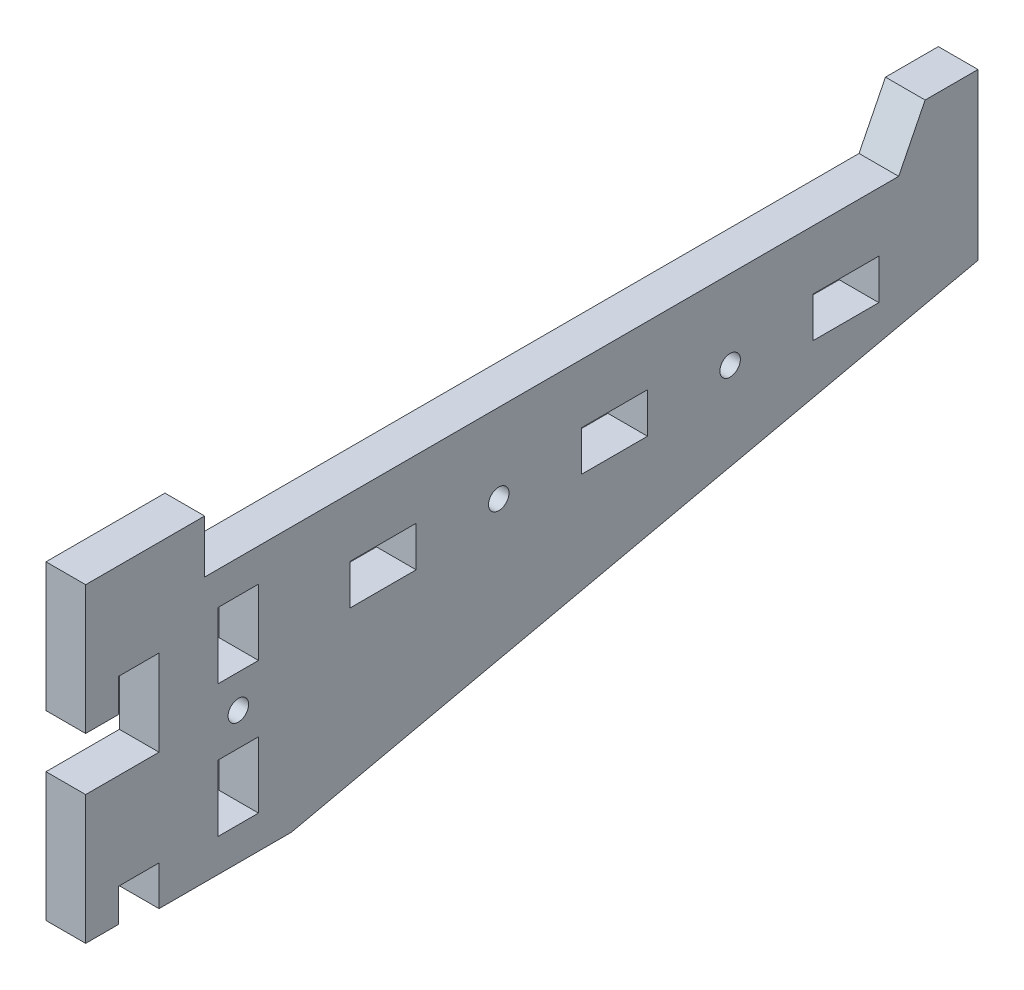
ISO-10303-21;
HEADER;
FILE_DESCRIPTION(('STEP AP214'),'2;1');
FILE_NAME('part.step','',(''),(''),'','','');
FILE_SCHEMA(('AUTOMOTIVE_DESIGN { 1 0 10303 214 1 1 1 1 }'));
ENDSEC;
DATA;
#1=APPLICATION_CONTEXT('core data for automotive mechanical design processes');
#2=APPLICATION_PROTOCOL_DEFINITION('international standard','automotive_design',2000,#1);
#3=PRODUCT_CONTEXT('',#1,'mechanical');
#4=PRODUCT('Part','Part','',(#3));
#5=PRODUCT_RELATED_PRODUCT_CATEGORY('part','',(#4));
#6=PRODUCT_DEFINITION_FORMATION('','',#4);
#7=PRODUCT_DEFINITION_CONTEXT('part definition',#1,'design');
#8=PRODUCT_DEFINITION('design','',#6,#7);
#9=PRODUCT_DEFINITION_SHAPE('','',#8);
#10=(LENGTH_UNIT() NAMED_UNIT(*) SI_UNIT(.MILLI.,.METRE.));
#11=(NAMED_UNIT(*) PLANE_ANGLE_UNIT() SI_UNIT($,.RADIAN.));
#12=(NAMED_UNIT(*) SI_UNIT($,.STERADIAN.) SOLID_ANGLE_UNIT());
#13=UNCERTAINTY_MEASURE_WITH_UNIT(LENGTH_MEASURE(1.E-05),#10,'distance_accuracy_value','');
#14=(GEOMETRIC_REPRESENTATION_CONTEXT(3) GLOBAL_UNCERTAINTY_ASSIGNED_CONTEXT((#13)) GLOBAL_UNIT_ASSIGNED_CONTEXT((#10,
#11,#12)) REPRESENTATION_CONTEXT('',''));
#15=CARTESIAN_POINT('',(0.,0.,0.));
#16=DIRECTION('',(0.,0.,1.));
#17=DIRECTION('',(1.,0.,0.));
#18=AXIS2_PLACEMENT_3D('',#15,#16,#17);
#19=CARTESIAN_POINT('',(6.,0.,-6.90000000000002));
#20=DIRECTION('',(0.,-1.,0.));
#21=DIRECTION('',(0.,0.,-1.));
#22=AXIS2_PLACEMENT_3D('',#19,#20,#21);
#23=PLANE('',#22);
#24=DIRECTION('',(0.,0.,1.));
#25=VECTOR('',#24,1.);
#26=CARTESIAN_POINT('',(0.,0.,-6.90000000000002));
#27=LINE('',#26,#25);
#28=CARTESIAN_POINT('',(0.,0.,-111.9));
#29=VERTEX_POINT('',#28);
#30=CARTESIAN_POINT('',(0.,0.,-6.90000000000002));
#31=VERTEX_POINT('',#30);
#32=EDGE_CURVE('E452',#29,#31,#27,.T.);
#33=ORIENTED_EDGE('',*,*,#32,.T.);
#34=DIRECTION('',(-1.,0.,0.));
#35=VECTOR('',#34,1.);
#36=CARTESIAN_POINT('',(6.,0.,-6.90000000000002));
#37=LINE('',#36,#35);
#38=CARTESIAN_POINT('',(6.,0.,-6.90000000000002));
#39=VERTEX_POINT('',#38);
#40=EDGE_CURVE('E11',#39,#31,#37,.T.);
#41=ORIENTED_EDGE('',*,*,#40,.F.);
#42=DIRECTION('',(0.,0.,1.));
#43=VECTOR('',#42,1.);
#44=CARTESIAN_POINT('',(6.,0.,-6.90000000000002));
#45=LINE('',#44,#43);
#46=CARTESIAN_POINT('',(6.,0.,-111.9));
#47=VERTEX_POINT('',#46);
#48=EDGE_CURVE('E459',#47,#39,#45,.T.);
#49=ORIENTED_EDGE('',*,*,#48,.F.);
#50=DIRECTION('',(-1.,0.,0.));
#51=VECTOR('',#50,1.);
#52=CARTESIAN_POINT('',(6.,0.,-111.9));
#53=LINE('',#52,#51);
#54=EDGE_CURVE('E499',#47,#29,#53,.T.);
#55=ORIENTED_EDGE('',*,*,#54,.T.);
#56=EDGE_LOOP('',(#33,#41,#49,#55));
#57=FACE_BOUND('',#56,.T.);
#58=ADVANCED_FACE('F34',(#57),#23,.F.);
#59=CARTESIAN_POINT('',(6.,8.,-6.90000000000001));
#60=DIRECTION('',(0.,0.,1.));
#61=DIRECTION('',(0.,-1.,0.));
#62=AXIS2_PLACEMENT_3D('',#59,#60,#61);
#63=PLANE('',#62);
#64=DIRECTION('',(0.,1.,0.));
#65=VECTOR('',#64,1.);
#66=CARTESIAN_POINT('',(0.,8.,-6.90000000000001));
#67=LINE('',#66,#65);
#68=CARTESIAN_POINT('',(0.,8.,-6.90000000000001));
#69=VERTEX_POINT('',#68);
#70=EDGE_CURVE('E502',#31,#69,#67,.T.);
#71=ORIENTED_EDGE('',*,*,#70,.T.);
#72=DIRECTION('',(-1.,0.,0.));
#73=VECTOR('',#72,1.);
#74=CARTESIAN_POINT('',(6.,8.,-6.90000000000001));
#75=LINE('',#74,#73);
#76=CARTESIAN_POINT('',(6.,8.,-6.90000000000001));
#77=VERTEX_POINT('',#76);
#78=EDGE_CURVE('E41',#77,#69,#75,.T.);
#79=ORIENTED_EDGE('',*,*,#78,.F.);
#80=DIRECTION('',(0.,1.,0.));
#81=VECTOR('',#80,1.);
#82=CARTESIAN_POINT('',(6.,8.,-6.90000000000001));
#83=LINE('',#82,#81);
#84=EDGE_CURVE('E462',#39,#77,#83,.T.);
#85=ORIENTED_EDGE('',*,*,#84,.F.);
#86=ORIENTED_EDGE('',*,*,#40,.T.);
#87=EDGE_LOOP('',(#71,#79,#85,#86));
#88=FACE_BOUND('',#87,.T.);
#89=ADVANCED_FACE('F613',(#88),#63,.F.);
#90=CARTESIAN_POINT('',(6.,8.,11.1));
#91=DIRECTION('',(0.,-1.,0.));
#92=DIRECTION('',(0.,0.,-1.));
#93=AXIS2_PLACEMENT_3D('',#90,#91,#92);
#94=PLANE('',#93);
#95=DIRECTION('',(0.,0.,1.));
#96=VECTOR('',#95,1.);
#97=CARTESIAN_POINT('',(0.,8.,11.1));
#98=LINE('',#97,#96);
#99=CARTESIAN_POINT('',(0.,8.,11.1));
#100=VERTEX_POINT('',#99);
#101=EDGE_CURVE('E504',#69,#100,#98,.T.);
#102=ORIENTED_EDGE('',*,*,#101,.T.);
#103=DIRECTION('',(-1.,0.,0.));
#104=VECTOR('',#103,1.);
#105=CARTESIAN_POINT('',(6.,8.,11.1));
#106=LINE('',#105,#104);
#107=CARTESIAN_POINT('',(6.,8.,11.1));
#108=VERTEX_POINT('',#107);
#109=EDGE_CURVE('E584',#108,#100,#106,.T.);
#110=ORIENTED_EDGE('',*,*,#109,.F.);
#111=DIRECTION('',(0.,0.,1.));
#112=VECTOR('',#111,1.);
#113=CARTESIAN_POINT('',(6.,8.,11.1));
#114=LINE('',#113,#112);
#115=EDGE_CURVE('E465',#77,#108,#114,.T.);
#116=ORIENTED_EDGE('',*,*,#115,.F.);
#117=ORIENTED_EDGE('',*,*,#78,.T.);
#118=EDGE_LOOP('',(#102,#110,#116,#117));
#119=FACE_BOUND('',#118,.T.);
#120=ADVANCED_FACE('F591',(#119),#94,.F.);
#121=CARTESIAN_POINT('',(6.,-11.5,11.1));
#122=DIRECTION('',(0.,0.,-1.));
#123=DIRECTION('',(-1.,0.,0.));
#124=AXIS2_PLACEMENT_3D('',#121,#122,#123);
#125=PLANE('',#124);
#126=DIRECTION('',(0.,-1.,0.));
#127=VECTOR('',#126,1.);
#128=CARTESIAN_POINT('',(0.,-11.5,11.1));
#129=LINE('',#128,#127);
#130=CARTESIAN_POINT('',(0.,-11.5,11.1));
#131=VERTEX_POINT('',#130);
#132=EDGE_CURVE('E506',#100,#131,#129,.T.);
#133=ORIENTED_EDGE('',*,*,#132,.T.);
#134=DIRECTION('',(-1.,0.,0.));
#135=VECTOR('',#134,1.);
#136=CARTESIAN_POINT('',(6.,-11.5,11.1));
#137=LINE('',#136,#135);
#138=CARTESIAN_POINT('',(6.,-11.5,11.1));
#139=VERTEX_POINT('',#138);
#140=EDGE_CURVE('E581',#139,#131,#137,.T.);
#141=ORIENTED_EDGE('',*,*,#140,.F.);
#142=DIRECTION('',(0.,-1.,0.));
#143=VECTOR('',#142,1.);
#144=CARTESIAN_POINT('',(6.,-11.5,11.1));
#145=LINE('',#144,#143);
#146=EDGE_CURVE('E467',#108,#139,#145,.T.);
#147=ORIENTED_EDGE('',*,*,#146,.F.);
#148=ORIENTED_EDGE('',*,*,#109,.T.);
#149=EDGE_LOOP('',(#133,#141,#147,#148));
#150=FACE_BOUND('',#149,.T.);
#151=ADVANCED_FACE('F601',(#150),#125,.F.);
#152=CARTESIAN_POINT('',(6.,-11.5,6.09999999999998));
#153=DIRECTION('',(0.,1.,0.));
#154=DIRECTION('',(0.,0.,1.));
#155=AXIS2_PLACEMENT_3D('',#152,#153,#154);
#156=PLANE('',#155);
#157=DIRECTION('',(0.,0.,-1.));
#158=VECTOR('',#157,1.);
#159=CARTESIAN_POINT('',(0.,-11.5,6.09999999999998));
#160=LINE('',#159,#158);
#161=CARTESIAN_POINT('',(0.,-11.5,6.09999999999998));
#162=VERTEX_POINT('',#161);
#163=EDGE_CURVE('E508',#131,#162,#160,.T.);
#164=ORIENTED_EDGE('',*,*,#163,.T.);
#165=DIRECTION('',(-1.,0.,0.));
#166=VECTOR('',#165,1.);
#167=CARTESIAN_POINT('',(6.,-11.5,6.09999999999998));
#168=LINE('',#167,#166);
#169=CARTESIAN_POINT('',(6.,-11.5,6.09999999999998));
#170=VERTEX_POINT('',#169);
#171=EDGE_CURVE('E578',#170,#162,#168,.T.);
#172=ORIENTED_EDGE('',*,*,#171,.F.);
#173=DIRECTION('',(0.,0.,-1.));
#174=VECTOR('',#173,1.);
#175=CARTESIAN_POINT('',(6.,-11.5,6.09999999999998));
#176=LINE('',#175,#174);
#177=EDGE_CURVE('E469',#139,#170,#176,.T.);
#178=ORIENTED_EDGE('',*,*,#177,.F.);
#179=ORIENTED_EDGE('',*,*,#140,.T.);
#180=EDGE_LOOP('',(#164,#172,#178,#179));
#181=FACE_BOUND('',#180,.T.);
#182=ADVANCED_FACE('F605',(#181),#156,.F.);
#183=CARTESIAN_POINT('',(6.,-6.5,6.09999999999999));
#184=DIRECTION('',(0.,0.,1.));
#185=DIRECTION('',(0.,-1.,0.));
#186=AXIS2_PLACEMENT_3D('',#183,#184,#185);
#187=PLANE('',#186);
#188=DIRECTION('',(0.,1.,0.));
#189=VECTOR('',#188,1.);
#190=CARTESIAN_POINT('',(0.,-6.5,6.09999999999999));
#191=LINE('',#190,#189);
#192=CARTESIAN_POINT('',(0.,-6.5,6.09999999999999));
#193=VERTEX_POINT('',#192);
#194=EDGE_CURVE('E510',#162,#193,#191,.T.);
#195=ORIENTED_EDGE('',*,*,#194,.T.);
#196=DIRECTION('',(-1.,0.,0.));
#197=VECTOR('',#196,1.);
#198=CARTESIAN_POINT('',(6.,-6.5,6.09999999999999));
#199=LINE('',#198,#197);
#200=CARTESIAN_POINT('',(6.,-6.5,6.09999999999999));
#201=VERTEX_POINT('',#200);
#202=EDGE_CURVE('E575',#201,#193,#199,.T.);
#203=ORIENTED_EDGE('',*,*,#202,.F.);
#204=DIRECTION('',(0.,1.,0.));
#205=VECTOR('',#204,1.);
#206=CARTESIAN_POINT('',(6.,-6.5,6.09999999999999));
#207=LINE('',#206,#205);
#208=EDGE_CURVE('E471',#170,#201,#207,.T.);
#209=ORIENTED_EDGE('',*,*,#208,.F.);
#210=ORIENTED_EDGE('',*,*,#171,.T.);
#211=EDGE_LOOP('',(#195,#203,#209,#210));
#212=FACE_BOUND('',#211,.T.);
#213=ADVANCED_FACE('F681',(#212),#187,.F.);
#214=CARTESIAN_POINT('',(6.,-6.5,0.));
#215=DIRECTION('',(0.,1.,0.));
#216=DIRECTION('',(0.,0.,1.));
#217=AXIS2_PLACEMENT_3D('',#214,#215,#216);
#218=PLANE('',#217);
#219=DIRECTION('',(0.,0.,-1.));
#220=VECTOR('',#219,1.);
#221=CARTESIAN_POINT('',(0.,-6.5,0.));
#222=LINE('',#221,#220);
#223=CARTESIAN_POINT('',(0.,-6.5,0.));
#224=VERTEX_POINT('',#223);
#225=EDGE_CURVE('E512',#193,#224,#222,.T.);
#226=ORIENTED_EDGE('',*,*,#225,.T.);
#227=DIRECTION('',(-1.,0.,0.));
#228=VECTOR('',#227,1.);
#229=CARTESIAN_POINT('',(6.,-6.5,0.));
#230=LINE('',#229,#228);
#231=CARTESIAN_POINT('',(6.,-6.5,0.));
#232=VERTEX_POINT('',#231);
#233=EDGE_CURVE('E572',#232,#224,#230,.T.);
#234=ORIENTED_EDGE('',*,*,#233,.F.);
#235=DIRECTION('',(0.,0.,-1.));
#236=VECTOR('',#235,1.);
#237=CARTESIAN_POINT('',(6.,-6.5,0.));
#238=LINE('',#237,#236);
#239=EDGE_CURVE('E473',#201,#232,#238,.T.);
#240=ORIENTED_EDGE('',*,*,#239,.F.);
#241=ORIENTED_EDGE('',*,*,#202,.T.);
#242=EDGE_LOOP('',(#226,#234,#240,#241));
#243=FACE_BOUND('',#242,.T.);
#244=ADVANCED_FACE('F678',(#243),#218,.F.);
#245=CARTESIAN_POINT('',(6.,-19.5,0.));
#246=DIRECTION('',(0.,0.,-1.));
#247=DIRECTION('',(0.,1.,0.));
#248=AXIS2_PLACEMENT_3D('',#245,#246,#247);
#249=PLANE('',#248);
#250=DIRECTION('',(0.,-1.,0.));
#251=VECTOR('',#250,1.);
#252=CARTESIAN_POINT('',(0.,-19.5,0.));
#253=LINE('',#252,#251);
#254=CARTESIAN_POINT('',(0.,-19.5,0.));
#255=VERTEX_POINT('',#254);
#256=EDGE_CURVE('E514',#224,#255,#253,.T.);
#257=ORIENTED_EDGE('',*,*,#256,.T.);
#258=DIRECTION('',(-1.,0.,0.));
#259=VECTOR('',#258,1.);
#260=CARTESIAN_POINT('',(6.,-19.5,0.));
#261=LINE('',#260,#259);
#262=CARTESIAN_POINT('',(6.,-19.5,0.));
#263=VERTEX_POINT('',#262);
#264=EDGE_CURVE('E569',#263,#255,#261,.T.);
#265=ORIENTED_EDGE('',*,*,#264,.F.);
#266=DIRECTION('',(0.,-1.,0.));
#267=VECTOR('',#266,1.);
#268=CARTESIAN_POINT('',(6.,-19.5,0.));
#269=LINE('',#268,#267);
#270=EDGE_CURVE('E475',#232,#263,#269,.T.);
#271=ORIENTED_EDGE('',*,*,#270,.F.);
#272=ORIENTED_EDGE('',*,*,#233,.T.);
#273=EDGE_LOOP('',(#257,#265,#271,#272));
#274=FACE_BOUND('',#273,.T.);
#275=ADVANCED_FACE('F674',(#274),#249,.F.);
#276=CARTESIAN_POINT('',(6.,-19.5,11.1));
#277=DIRECTION('',(0.,-1.,0.));
#278=DIRECTION('',(0.,0.,-1.));
#279=AXIS2_PLACEMENT_3D('',#276,#277,#278);
#280=PLANE('',#279);
#281=DIRECTION('',(0.,0.,1.));
#282=VECTOR('',#281,1.);
#283=CARTESIAN_POINT('',(0.,-19.5,11.1));
#284=LINE('',#283,#282);
#285=CARTESIAN_POINT('',(0.,-19.5,11.1));
#286=VERTEX_POINT('',#285);
#287=EDGE_CURVE('E516',#255,#286,#284,.T.);
#288=ORIENTED_EDGE('',*,*,#287,.T.);
#289=DIRECTION('',(-1.,0.,0.));
#290=VECTOR('',#289,1.);
#291=CARTESIAN_POINT('',(6.,-19.5,11.1));
#292=LINE('',#291,#290);
#293=CARTESIAN_POINT('',(6.,-19.5,11.1));
#294=VERTEX_POINT('',#293);
#295=EDGE_CURVE('E566',#294,#286,#292,.T.);
#296=ORIENTED_EDGE('',*,*,#295,.F.);
#297=DIRECTION('',(0.,0.,1.));
#298=VECTOR('',#297,1.);
#299=CARTESIAN_POINT('',(6.,-19.5,11.1));
#300=LINE('',#299,#298);
#301=EDGE_CURVE('E477',#263,#294,#300,.T.);
#302=ORIENTED_EDGE('',*,*,#301,.F.);
#303=ORIENTED_EDGE('',*,*,#264,.T.);
#304=EDGE_LOOP('',(#288,#296,#302,#303));
#305=FACE_BOUND('',#304,.T.);
#306=ADVANCED_FACE('F670',(#305),#280,.F.);
#307=CARTESIAN_POINT('',(6.,-39.,11.1));
#308=DIRECTION('',(0.,0.,-1.));
#309=DIRECTION('',(-1.,0.,0.));
#310=AXIS2_PLACEMENT_3D('',#307,#308,#309);
#311=PLANE('',#310);
#312=DIRECTION('',(0.,-1.,0.));
#313=VECTOR('',#312,1.);
#314=CARTESIAN_POINT('',(0.,-39.,11.1));
#315=LINE('',#314,#313);
#316=CARTESIAN_POINT('',(0.,-39.,11.1));
#317=VERTEX_POINT('',#316);
#318=EDGE_CURVE('E518',#286,#317,#315,.T.);
#319=ORIENTED_EDGE('',*,*,#318,.T.);
#320=DIRECTION('',(-1.,0.,0.));
#321=VECTOR('',#320,1.);
#322=CARTESIAN_POINT('',(6.,-39.,11.1));
#323=LINE('',#322,#321);
#324=CARTESIAN_POINT('',(6.,-39.,11.1));
#325=VERTEX_POINT('',#324);
#326=EDGE_CURVE('E563',#325,#317,#323,.T.);
#327=ORIENTED_EDGE('',*,*,#326,.F.);
#328=DIRECTION('',(0.,-1.,0.));
#329=VECTOR('',#328,1.);
#330=CARTESIAN_POINT('',(6.,-39.,11.1));
#331=LINE('',#330,#329);
#332=EDGE_CURVE('E479',#294,#325,#331,.T.);
#333=ORIENTED_EDGE('',*,*,#332,.F.);
#334=ORIENTED_EDGE('',*,*,#295,.T.);
#335=EDGE_LOOP('',(#319,#327,#333,#334));
#336=FACE_BOUND('',#335,.T.);
#337=ADVANCED_FACE('F665',(#336),#311,.F.);
#338=CARTESIAN_POINT('',(6.,-39.,6.09999999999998));
#339=DIRECTION('',(0.,1.,0.));
#340=DIRECTION('',(0.,0.,1.));
#341=AXIS2_PLACEMENT_3D('',#338,#339,#340);
#342=PLANE('',#341);
#343=DIRECTION('',(0.,0.,-1.));
#344=VECTOR('',#343,1.);
#345=CARTESIAN_POINT('',(0.,-39.,6.09999999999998));
#346=LINE('',#345,#344);
#347=CARTESIAN_POINT('',(0.,-39.,6.09999999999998));
#348=VERTEX_POINT('',#347);
#349=EDGE_CURVE('E520',#317,#348,#346,.T.);
#350=ORIENTED_EDGE('',*,*,#349,.T.);
#351=DIRECTION('',(-1.,0.,0.));
#352=VECTOR('',#351,1.);
#353=CARTESIAN_POINT('',(6.,-39.,6.09999999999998));
#354=LINE('',#353,#352);
#355=CARTESIAN_POINT('',(6.,-39.,6.09999999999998));
#356=VERTEX_POINT('',#355);
#357=EDGE_CURVE('E560',#356,#348,#354,.T.);
#358=ORIENTED_EDGE('',*,*,#357,.F.);
#359=DIRECTION('',(0.,0.,-1.));
#360=VECTOR('',#359,1.);
#361=CARTESIAN_POINT('',(6.,-39.,6.09999999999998));
#362=LINE('',#361,#360);
#363=EDGE_CURVE('E481',#325,#356,#362,.T.);
#364=ORIENTED_EDGE('',*,*,#363,.F.);
#365=ORIENTED_EDGE('',*,*,#326,.T.);
#366=EDGE_LOOP('',(#350,#358,#364,#365));
#367=FACE_BOUND('',#366,.T.);
#368=ADVANCED_FACE('F659',(#367),#342,.F.);
#369=CARTESIAN_POINT('',(6.,-34.,6.09999999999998));
#370=DIRECTION('',(0.,0.,1.));
#371=DIRECTION('',(0.,-1.,0.));
#372=AXIS2_PLACEMENT_3D('',#369,#370,#371);
#373=PLANE('',#372);
#374=DIRECTION('',(0.,1.,0.));
#375=VECTOR('',#374,1.);
#376=CARTESIAN_POINT('',(0.,-34.,6.09999999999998));
#377=LINE('',#376,#375);
#378=CARTESIAN_POINT('',(0.,-34.,6.09999999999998));
#379=VERTEX_POINT('',#378);
#380=EDGE_CURVE('E522',#348,#379,#377,.T.);
#381=ORIENTED_EDGE('',*,*,#380,.T.);
#382=DIRECTION('',(-1.,0.,0.));
#383=VECTOR('',#382,1.);
#384=CARTESIAN_POINT('',(6.,-34.,6.09999999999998));
#385=LINE('',#384,#383);
#386=CARTESIAN_POINT('',(6.,-34.,6.09999999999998));
#387=VERTEX_POINT('',#386);
#388=EDGE_CURVE('E557',#387,#379,#385,.T.);
#389=ORIENTED_EDGE('',*,*,#388,.F.);
#390=DIRECTION('',(0.,1.,0.));
#391=VECTOR('',#390,1.);
#392=CARTESIAN_POINT('',(6.,-34.,6.09999999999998));
#393=LINE('',#392,#391);
#394=EDGE_CURVE('E483',#356,#387,#393,.T.);
#395=ORIENTED_EDGE('',*,*,#394,.F.);
#396=ORIENTED_EDGE('',*,*,#357,.T.);
#397=EDGE_LOOP('',(#381,#389,#395,#396));
#398=FACE_BOUND('',#397,.T.);
#399=ADVANCED_FACE('F655',(#398),#373,.F.);
#400=CARTESIAN_POINT('',(6.,-34.,0.));
#401=DIRECTION('',(0.,1.,0.));
#402=DIRECTION('',(0.,0.,1.));
#403=AXIS2_PLACEMENT_3D('',#400,#401,#402);
#404=PLANE('',#403);
#405=DIRECTION('',(0.,0.,-1.));
#406=VECTOR('',#405,1.);
#407=CARTESIAN_POINT('',(0.,-34.,0.));
#408=LINE('',#407,#406);
#409=CARTESIAN_POINT('',(0.,-34.,0.));
#410=VERTEX_POINT('',#409);
#411=EDGE_CURVE('E524',#379,#410,#408,.T.);
#412=ORIENTED_EDGE('',*,*,#411,.T.);
#413=DIRECTION('',(-1.,0.,0.));
#414=VECTOR('',#413,1.);
#415=CARTESIAN_POINT('',(6.,-34.,0.));
#416=LINE('',#415,#414);
#417=CARTESIAN_POINT('',(6.,-34.,0.));
#418=VERTEX_POINT('',#417);
#419=EDGE_CURVE('E554',#418,#410,#416,.T.);
#420=ORIENTED_EDGE('',*,*,#419,.F.);
#421=DIRECTION('',(0.,0.,-1.));
#422=VECTOR('',#421,1.);
#423=CARTESIAN_POINT('',(6.,-34.,0.));
#424=LINE('',#423,#422);
#425=EDGE_CURVE('E485',#387,#418,#424,.T.);
#426=ORIENTED_EDGE('',*,*,#425,.F.);
#427=ORIENTED_EDGE('',*,*,#388,.T.);
#428=EDGE_LOOP('',(#412,#420,#426,#427));
#429=FACE_BOUND('',#428,.T.);
#430=ADVANCED_FACE('F650',(#429),#404,.F.);
#431=CARTESIAN_POINT('',(6.,-40.,0.));
#432=DIRECTION('',(0.,0.,-1.));
#433=DIRECTION('',(-1.,0.,0.));
#434=AXIS2_PLACEMENT_3D('',#431,#432,#433);
#435=PLANE('',#434);
#436=DIRECTION('',(0.,-1.,0.));
#437=VECTOR('',#436,1.);
#438=CARTESIAN_POINT('',(0.,-40.,0.));
#439=LINE('',#438,#437);
#440=CARTESIAN_POINT('',(0.,-40.,0.));
#441=VERTEX_POINT('',#440);
#442=EDGE_CURVE('E526',#410,#441,#439,.T.);
#443=ORIENTED_EDGE('',*,*,#442,.T.);
#444=DIRECTION('',(-1.,0.,0.));
#445=VECTOR('',#444,1.);
#446=CARTESIAN_POINT('',(6.,-40.,0.));
#447=LINE('',#446,#445);
#448=CARTESIAN_POINT('',(6.,-40.,0.));
#449=VERTEX_POINT('',#448);
#450=EDGE_CURVE('E551',#449,#441,#447,.T.);
#451=ORIENTED_EDGE('',*,*,#450,.F.);
#452=DIRECTION('',(0.,-1.,0.));
#453=VECTOR('',#452,1.);
#454=CARTESIAN_POINT('',(6.,-40.,0.));
#455=LINE('',#454,#453);
#456=EDGE_CURVE('E487',#418,#449,#455,.T.);
#457=ORIENTED_EDGE('',*,*,#456,.F.);
#458=ORIENTED_EDGE('',*,*,#419,.T.);
#459=EDGE_LOOP('',(#443,#451,#457,#458));
#460=FACE_BOUND('',#459,.T.);
#461=ADVANCED_FACE('F644',(#460),#435,.F.);
#462=CARTESIAN_POINT('',(6.,-40.,0.));
#463=DIRECTION('',(0.,1.,0.));
#464=DIRECTION('',(0.,0.,1.));
#465=AXIS2_PLACEMENT_3D('',#462,#463,#464);
#466=PLANE('',#465);
#467=DIRECTION('',(0.,0.,-1.));
#468=VECTOR('',#467,1.);
#469=CARTESIAN_POINT('',(0.,-40.,0.));
#470=LINE('',#469,#468);
#471=CARTESIAN_POINT('',(0.,-40.,-20.));
#472=VERTEX_POINT('',#471);
#473=EDGE_CURVE('E528',#441,#472,#470,.T.);
#474=ORIENTED_EDGE('',*,*,#473,.T.);
#475=DIRECTION('',(-1.,0.,0.));
#476=VECTOR('',#475,1.);
#477=CARTESIAN_POINT('',(6.,-40.,-20.));
#478=LINE('',#477,#476);
#479=CARTESIAN_POINT('',(6.,-40.,-20.));
#480=VERTEX_POINT('',#479);
#481=EDGE_CURVE('E548',#480,#472,#478,.T.);
#482=ORIENTED_EDGE('',*,*,#481,.F.);
#483=DIRECTION('',(0.,0.,-1.));
#484=VECTOR('',#483,1.);
#485=CARTESIAN_POINT('',(6.,-40.,0.));
#486=LINE('',#485,#484);
#487=EDGE_CURVE('E489',#449,#480,#486,.T.);
#488=ORIENTED_EDGE('',*,*,#487,.F.);
#489=ORIENTED_EDGE('',*,*,#450,.T.);
#490=EDGE_LOOP('',(#474,#482,#488,#489));
#491=FACE_BOUND('',#490,.T.);
#492=ADVANCED_FACE('F640',(#491),#466,.F.);
#493=CARTESIAN_POINT('',(6.,-40.,-20.));
#494=DIRECTION('',(0.,0.976363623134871,0.216134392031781));
#495=DIRECTION('',(0.,-0.216134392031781,0.976363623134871));
#496=AXIS2_PLACEMENT_3D('',#493,#494,#495);
#497=PLANE('',#496);
#498=DIRECTION('',(0.,0.216134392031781,-0.976363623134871));
#499=VECTOR('',#498,1.);
#500=CARTESIAN_POINT('',(0.,-40.,-20.));
#501=LINE('',#500,#499);
#502=CARTESIAN_POINT('',(0.,-17.,-123.9));
#503=VERTEX_POINT('',#502);
#504=EDGE_CURVE('E530',#472,#503,#501,.T.);
#505=ORIENTED_EDGE('',*,*,#504,.T.);
#506=DIRECTION('',(-1.,0.,0.));
#507=VECTOR('',#506,1.);
#508=CARTESIAN_POINT('',(6.,-17.,-123.9));
#509=LINE('',#508,#507);
#510=CARTESIAN_POINT('',(6.,-17.,-123.9));
#511=VERTEX_POINT('',#510);
#512=EDGE_CURVE('E545',#511,#503,#509,.T.);
#513=ORIENTED_EDGE('',*,*,#512,.F.);
#514=DIRECTION('',(0.,0.216134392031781,-0.976363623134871));
#515=VECTOR('',#514,1.);
#516=CARTESIAN_POINT('',(6.,-40.,-20.));
#517=LINE('',#516,#515);
#518=EDGE_CURVE('E491',#480,#511,#517,.T.);
#519=ORIENTED_EDGE('',*,*,#518,.F.);
#520=ORIENTED_EDGE('',*,*,#481,.T.);
#521=EDGE_LOOP('',(#505,#513,#519,#520));
#522=FACE_BOUND('',#521,.T.);
#523=ADVANCED_FACE('F635',(#522),#497,.F.);
#524=CARTESIAN_POINT('',(6.,8.,-123.9));
#525=DIRECTION('',(0.,0.,1.));
#526=DIRECTION('',(1.,0.,0.));
#527=AXIS2_PLACEMENT_3D('',#524,#525,#526);
#528=PLANE('',#527);
#529=DIRECTION('',(0.,1.,0.));
#530=VECTOR('',#529,1.);
#531=CARTESIAN_POINT('',(0.,8.,-123.9));
#532=LINE('',#531,#530);
#533=CARTESIAN_POINT('',(0.,8.,-123.9));
#534=VERTEX_POINT('',#533);
#535=EDGE_CURVE('E532',#503,#534,#532,.T.);
#536=ORIENTED_EDGE('',*,*,#535,.T.);
#537=DIRECTION('',(-1.,0.,0.));
#538=VECTOR('',#537,1.);
#539=CARTESIAN_POINT('',(6.,8.,-123.9));
#540=LINE('',#539,#538);
#541=CARTESIAN_POINT('',(6.,8.,-123.9));
#542=VERTEX_POINT('',#541);
#543=EDGE_CURVE('E542',#542,#534,#540,.T.);
#544=ORIENTED_EDGE('',*,*,#543,.F.);
#545=DIRECTION('',(0.,1.,0.));
#546=VECTOR('',#545,1.);
#547=CARTESIAN_POINT('',(6.,8.,-123.9));
#548=LINE('',#547,#546);
#549=EDGE_CURVE('E493',#511,#542,#548,.T.);
#550=ORIENTED_EDGE('',*,*,#549,.F.);
#551=ORIENTED_EDGE('',*,*,#512,.T.);
#552=EDGE_LOOP('',(#536,#544,#550,#551));
#553=FACE_BOUND('',#552,.T.);
#554=ADVANCED_FACE('F629',(#553),#528,.F.);
#555=CARTESIAN_POINT('',(6.,8.,-115.9));
#556=DIRECTION('',(0.,-1.,0.));
#557=DIRECTION('',(0.,0.,-1.));
#558=AXIS2_PLACEMENT_3D('',#555,#556,#557);
#559=PLANE('',#558);
#560=DIRECTION('',(0.,0.,1.));
#561=VECTOR('',#560,1.);
#562=CARTESIAN_POINT('',(0.,8.,-115.9));
#563=LINE('',#562,#561);
#564=CARTESIAN_POINT('',(0.,8.,-115.9));
#565=VERTEX_POINT('',#564);
#566=EDGE_CURVE('E534',#534,#565,#563,.T.);
#567=ORIENTED_EDGE('',*,*,#566,.T.);
#568=DIRECTION('',(-1.,0.,0.));
#569=VECTOR('',#568,1.);
#570=CARTESIAN_POINT('',(6.,8.,-115.9));
#571=LINE('',#570,#569);
#572=CARTESIAN_POINT('',(6.,8.,-115.9));
#573=VERTEX_POINT('',#572);
#574=EDGE_CURVE('E539',#573,#565,#571,.T.);
#575=ORIENTED_EDGE('',*,*,#574,.F.);
#576=DIRECTION('',(0.,0.,1.));
#577=VECTOR('',#576,1.);
#578=CARTESIAN_POINT('',(6.,8.,-115.9));
#579=LINE('',#578,#577);
#580=EDGE_CURVE('E495',#542,#573,#579,.T.);
#581=ORIENTED_EDGE('',*,*,#580,.F.);
#582=ORIENTED_EDGE('',*,*,#543,.T.);
#583=EDGE_LOOP('',(#567,#575,#581,#582));
#584=FACE_BOUND('',#583,.T.);
#585=ADVANCED_FACE('F625',(#584),#559,.F.);
#586=CARTESIAN_POINT('',(6.,0.,-111.9));
#587=DIRECTION('',(0.,-0.447213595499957,-0.894427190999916));
#588=DIRECTION('',(0.,0.894427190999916,-0.447213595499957));
#589=AXIS2_PLACEMENT_3D('',#586,#587,#588);
#590=PLANE('',#589);
#591=DIRECTION('',(0.,-0.894427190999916,0.447213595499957));
#592=VECTOR('',#591,1.);
#593=CARTESIAN_POINT('',(0.,0.,-111.9));
#594=LINE('',#593,#592);
#595=EDGE_CURVE('E463',#565,#29,#594,.T.);
#596=ORIENTED_EDGE('',*,*,#595,.T.);
#597=ORIENTED_EDGE('',*,*,#54,.F.);
#598=DIRECTION('',(0.,-0.894427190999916,0.447213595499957));
#599=VECTOR('',#598,1.);
#600=CARTESIAN_POINT('',(6.,0.,-111.9));
#601=LINE('',#600,#599);
#602=EDGE_CURVE('E497',#573,#47,#601,.T.);
#603=ORIENTED_EDGE('',*,*,#602,.F.);
#604=ORIENTED_EDGE('',*,*,#574,.T.);
#605=EDGE_LOOP('',(#596,#597,#603,#604));
#606=FACE_BOUND('',#605,.T.);
#607=ADVANCED_FACE('F620',(#606),#590,.F.);
#608=CARTESIAN_POINT('',(6.,0.,0.));
#609=DIRECTION('',(-1.,0.,0.));
#610=DIRECTION('',(0.,0.,1.));
#611=AXIS2_PLACEMENT_3D('',#608,#609,#610);
#612=PLANE('',#611);
#613=CARTESIAN_POINT('',(6.,-12.,-86.4));
#614=DIRECTION('',(1.,0.,0.));
#615=DIRECTION('',(0.,0.,-1.));
#616=AXIS2_PLACEMENT_3D('',#613,#614,#615);
#617=CIRCLE('',#616,1.54999999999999);
#618=CARTESIAN_POINT('',(6.,-12.,-87.95));
#619=VERTEX_POINT('',#618);
#620=EDGE_CURVE('E1067',#619,#619,#617,.T.);
#621=ORIENTED_EDGE('',*,*,#620,.F.);
#622=EDGE_LOOP('',(#621));
#623=FACE_BOUND('',#622,.T.);
#624=CARTESIAN_POINT('',(6.,-12.,-51.4));
#625=DIRECTION('',(1.,0.,0.));
#626=DIRECTION('',(0.,0.,-1.));
#627=AXIS2_PLACEMENT_3D('',#624,#625,#626);
#628=CIRCLE('',#627,1.55);
#629=CARTESIAN_POINT('',(6.,-12.,-52.95));
#630=VERTEX_POINT('',#629);
#631=EDGE_CURVE('E308',#630,#630,#628,.T.);
#632=ORIENTED_EDGE('',*,*,#631,.F.);
#633=EDGE_LOOP('',(#632));
#634=FACE_BOUND('',#633,.T.);
#635=DIRECTION('',(0.,0.,-1.));
#636=VECTOR('',#635,1.);
#637=CARTESIAN_POINT('',(6.,-15.05,-98.9));
#638=LINE('',#637,#636);
#639=CARTESIAN_POINT('',(6.,-15.05,-98.9));
#640=VERTEX_POINT('',#639);
#641=CARTESIAN_POINT('',(6.,-15.05,-108.9));
#642=VERTEX_POINT('',#641);
#643=EDGE_CURVE('E314',#640,#642,#638,.T.);
#644=ORIENTED_EDGE('',*,*,#643,.F.);
#645=DIRECTION('',(0.,-1.,0.));
#646=VECTOR('',#645,1.);
#647=CARTESIAN_POINT('',(6.,-8.95000000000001,-98.9));
#648=LINE('',#647,#646);
#649=CARTESIAN_POINT('',(6.,-8.95000000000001,-98.9));
#650=VERTEX_POINT('',#649);
#651=EDGE_CURVE('E48',#650,#640,#648,.T.);
#652=ORIENTED_EDGE('',*,*,#651,.F.);
#653=DIRECTION('',(0.,0.,1.));
#654=VECTOR('',#653,1.);
#655=CARTESIAN_POINT('',(6.,-8.95000000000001,-98.9));
#656=LINE('',#655,#654);
#657=CARTESIAN_POINT('',(6.,-8.95000000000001,-108.9));
#658=VERTEX_POINT('',#657);
#659=EDGE_CURVE('E302',#658,#650,#656,.T.);
#660=ORIENTED_EDGE('',*,*,#659,.F.);
#661=DIRECTION('',(0.,1.,0.));
#662=VECTOR('',#661,1.);
#663=CARTESIAN_POINT('',(6.,-8.95000000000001,-108.9));
#664=LINE('',#663,#662);
#665=EDGE_CURVE('E305',#642,#658,#664,.T.);
#666=ORIENTED_EDGE('',*,*,#665,.F.);
#667=EDGE_LOOP('',(#644,#652,#660,#666));
#668=FACE_BOUND('',#667,.T.);
#669=DIRECTION('',(0.,0.,-1.));
#670=VECTOR('',#669,1.);
#671=CARTESIAN_POINT('',(6.,-15.05,-63.9));
#672=LINE('',#671,#670);
#673=CARTESIAN_POINT('',(6.,-15.05,-63.9));
#674=VERTEX_POINT('',#673);
#675=CARTESIAN_POINT('',(6.,-15.05,-73.9));
#676=VERTEX_POINT('',#675);
#677=EDGE_CURVE('E340',#674,#676,#672,.T.);
#678=ORIENTED_EDGE('',*,*,#677,.F.);
#679=DIRECTION('',(0.,-1.,0.));
#680=VECTOR('',#679,1.);
#681=CARTESIAN_POINT('',(6.,-8.95000000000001,-63.9));
#682=LINE('',#681,#680);
#683=CARTESIAN_POINT('',(6.,-8.95000000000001,-63.9));
#684=VERTEX_POINT('',#683);
#685=EDGE_CURVE('E321',#684,#674,#682,.T.);
#686=ORIENTED_EDGE('',*,*,#685,.F.);
#687=DIRECTION('',(0.,0.,1.));
#688=VECTOR('',#687,1.);
#689=CARTESIAN_POINT('',(6.,-8.95000000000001,-63.9));
#690=LINE('',#689,#688);
#691=CARTESIAN_POINT('',(6.,-8.95000000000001,-73.9));
#692=VERTEX_POINT('',#691);
#693=EDGE_CURVE('E329',#692,#684,#690,.T.);
#694=ORIENTED_EDGE('',*,*,#693,.F.);
#695=DIRECTION('',(0.,1.,0.));
#696=VECTOR('',#695,1.);
#697=CARTESIAN_POINT('',(6.,-8.95000000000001,-73.9));
#698=LINE('',#697,#696);
#699=EDGE_CURVE('E343',#676,#692,#698,.T.);
#700=ORIENTED_EDGE('',*,*,#699,.F.);
#701=EDGE_LOOP('',(#678,#686,#694,#700));
#702=FACE_BOUND('',#701,.T.);
#703=DIRECTION('',(0.,0.,-1.));
#704=VECTOR('',#703,1.);
#705=CARTESIAN_POINT('',(6.,-15.05,-28.9));
#706=LINE('',#705,#704);
#707=CARTESIAN_POINT('',(6.,-15.05,-28.9));
#708=VERTEX_POINT('',#707);
#709=CARTESIAN_POINT('',(6.,-15.05,-38.9));
#710=VERTEX_POINT('',#709);
#711=EDGE_CURVE('E372',#708,#710,#706,.T.);
#712=ORIENTED_EDGE('',*,*,#711,.F.);
#713=DIRECTION('',(0.,-1.,0.));
#714=VECTOR('',#713,1.);
#715=CARTESIAN_POINT('',(6.,-8.95000000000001,-28.9));
#716=LINE('',#715,#714);
#717=CARTESIAN_POINT('',(6.,-8.95000000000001,-28.9));
#718=VERTEX_POINT('',#717);
#719=EDGE_CURVE('E350',#718,#708,#716,.T.);
#720=ORIENTED_EDGE('',*,*,#719,.F.);
#721=DIRECTION('',(0.,0.,1.));
#722=VECTOR('',#721,1.);
#723=CARTESIAN_POINT('',(6.,-8.95000000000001,-28.9));
#724=LINE('',#723,#722);
#725=CARTESIAN_POINT('',(6.,-8.95000000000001,-38.9));
#726=VERTEX_POINT('',#725);
#727=EDGE_CURVE('E361',#726,#718,#724,.T.);
#728=ORIENTED_EDGE('',*,*,#727,.F.);
#729=DIRECTION('',(0.,1.,0.));
#730=VECTOR('',#729,1.);
#731=CARTESIAN_POINT('',(6.,-8.95000000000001,-38.9));
#732=LINE('',#731,#730);
#733=EDGE_CURVE('E375',#710,#726,#732,.T.);
#734=ORIENTED_EDGE('',*,*,#733,.F.);
#735=EDGE_LOOP('',(#712,#720,#728,#734));
#736=FACE_BOUND('',#735,.T.);
#737=CARTESIAN_POINT('',(6.,-20.,-12.));
#738=DIRECTION('',(1.,0.,0.));
#739=DIRECTION('',(0.,0.,-1.));
#740=AXIS2_PLACEMENT_3D('',#737,#738,#739);
#741=CIRCLE('',#740,1.55);
#742=CARTESIAN_POINT('',(6.,-20.,-13.55));
#743=VERTEX_POINT('',#742);
#744=EDGE_CURVE('E382',#743,#743,#741,.T.);
#745=ORIENTED_EDGE('',*,*,#744,.F.);
#746=EDGE_LOOP('',(#745));
#747=FACE_BOUND('',#746,.T.);
#748=DIRECTION('',(0.,1.,0.));
#749=VECTOR('',#748,1.);
#750=CARTESIAN_POINT('',(6.,-35.,-15.05));
#751=LINE('',#750,#749);
#752=CARTESIAN_POINT('',(6.,-35.,-15.05));
#753=VERTEX_POINT('',#752);
#754=CARTESIAN_POINT('',(6.,-25.,-15.05));
#755=VERTEX_POINT('',#754);
#756=EDGE_CURVE('E410',#753,#755,#751,.T.);
#757=ORIENTED_EDGE('',*,*,#756,.F.);
#758=DIRECTION('',(0.,0.,-1.));
#759=VECTOR('',#758,1.);
#760=CARTESIAN_POINT('',(6.,-35.,-8.95000000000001));
#761=LINE('',#760,#759);
#762=CARTESIAN_POINT('',(6.,-35.,-8.95000000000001));
#763=VERTEX_POINT('',#762);
#764=EDGE_CURVE('E392',#763,#753,#761,.T.);
#765=ORIENTED_EDGE('',*,*,#764,.F.);
#766=DIRECTION('',(0.,-1.,0.));
#767=VECTOR('',#766,1.);
#768=CARTESIAN_POINT('',(6.,-35.,-8.95000000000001));
#769=LINE('',#768,#767);
#770=CARTESIAN_POINT('',(6.,-25.,-8.95000000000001));
#771=VERTEX_POINT('',#770);
#772=EDGE_CURVE('E399',#771,#763,#769,.T.);
#773=ORIENTED_EDGE('',*,*,#772,.F.);
#774=DIRECTION('',(0.,0.,1.));
#775=VECTOR('',#774,1.);
#776=CARTESIAN_POINT('',(6.,-25.,-8.95000000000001));
#777=LINE('',#776,#775);
#778=EDGE_CURVE('E413',#755,#771,#777,.T.);
#779=ORIENTED_EDGE('',*,*,#778,.F.);
#780=EDGE_LOOP('',(#757,#765,#773,#779));
#781=FACE_BOUND('',#780,.T.);
#782=DIRECTION('',(0.,0.,-1.));
#783=VECTOR('',#782,1.);
#784=CARTESIAN_POINT('',(6.,-15.,-8.95));
#785=LINE('',#784,#783);
#786=CARTESIAN_POINT('',(6.,-15.,-8.95));
#787=VERTEX_POINT('',#786);
#788=CARTESIAN_POINT('',(6.,-15.,-15.05));
#789=VERTEX_POINT('',#788);
#790=EDGE_CURVE('E442',#787,#789,#785,.T.);
#791=ORIENTED_EDGE('',*,*,#790,.F.);
#792=DIRECTION('',(0.,-1.,0.));
#793=VECTOR('',#792,1.);
#794=CARTESIAN_POINT('',(6.,-5.,-8.95));
#795=LINE('',#794,#793);
#796=CARTESIAN_POINT('',(6.,-5.,-8.95));
#797=VERTEX_POINT('',#796);
#798=EDGE_CURVE('E420',#797,#787,#795,.T.);
#799=ORIENTED_EDGE('',*,*,#798,.F.);
#800=DIRECTION('',(0.,0.,1.));
#801=VECTOR('',#800,1.);
#802=CARTESIAN_POINT('',(6.,-5.,-8.95));
#803=LINE('',#802,#801);
#804=CARTESIAN_POINT('',(6.,-4.99999999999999,-15.05));
#805=VERTEX_POINT('',#804);
#806=EDGE_CURVE('E431',#805,#797,#803,.T.);
#807=ORIENTED_EDGE('',*,*,#806,.F.);
#808=DIRECTION('',(0.,1.,0.));
#809=VECTOR('',#808,1.);
#810=CARTESIAN_POINT('',(6.,-4.99999999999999,-15.05));
#811=LINE('',#810,#809);
#812=EDGE_CURVE('E445',#789,#805,#811,.T.);
#813=ORIENTED_EDGE('',*,*,#812,.F.);
#814=EDGE_LOOP('',(#791,#799,#807,#813));
#815=FACE_BOUND('',#814,.T.);
#816=ORIENTED_EDGE('',*,*,#48,.T.);
#817=ORIENTED_EDGE('',*,*,#84,.T.);
#818=ORIENTED_EDGE('',*,*,#115,.T.);
#819=ORIENTED_EDGE('',*,*,#146,.T.);
#820=ORIENTED_EDGE('',*,*,#177,.T.);
#821=ORIENTED_EDGE('',*,*,#208,.T.);
#822=ORIENTED_EDGE('',*,*,#239,.T.);
#823=ORIENTED_EDGE('',*,*,#270,.T.);
#824=ORIENTED_EDGE('',*,*,#301,.T.);
#825=ORIENTED_EDGE('',*,*,#332,.T.);
#826=ORIENTED_EDGE('',*,*,#363,.T.);
#827=ORIENTED_EDGE('',*,*,#394,.T.);
#828=ORIENTED_EDGE('',*,*,#425,.T.);
#829=ORIENTED_EDGE('',*,*,#456,.T.);
#830=ORIENTED_EDGE('',*,*,#487,.T.);
#831=ORIENTED_EDGE('',*,*,#518,.T.);
#832=ORIENTED_EDGE('',*,*,#549,.T.);
#833=ORIENTED_EDGE('',*,*,#580,.T.);
#834=ORIENTED_EDGE('',*,*,#602,.T.);
#835=EDGE_LOOP('',(#816,#817,#818,#819,#820,#821,#822,#823,#824,#825,#826,#827,#828,#829,#830,
#831,#832,#833,#834));
#836=FACE_BOUND('',#835,.T.);
#837=ADVANCED_FACE('F609',(#623,#634,#668,#702,#736,#747,#781,#815,#836),#612,.F.);
#838=CARTESIAN_POINT('',(0.,0.,0.));
#839=DIRECTION('',(-1.,0.,0.));
#840=DIRECTION('',(0.,0.,1.));
#841=AXIS2_PLACEMENT_3D('',#838,#839,#840);
#842=PLANE('',#841);
#843=CARTESIAN_POINT('',(0.,-12.,-86.4));
#844=DIRECTION('',(1.,0.,0.));
#845=DIRECTION('',(0.,0.,-1.));
#846=AXIS2_PLACEMENT_3D('',#843,#844,#845);
#847=CIRCLE('',#846,1.54999999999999);
#848=CARTESIAN_POINT('',(0.,-12.,-87.95));
#849=VERTEX_POINT('',#848);
#850=EDGE_CURVE('E1064',#849,#849,#847,.T.);
#851=ORIENTED_EDGE('',*,*,#850,.T.);
#852=EDGE_LOOP('',(#851));
#853=FACE_BOUND('',#852,.T.);
#854=CARTESIAN_POINT('',(0.,-12.,-51.4));
#855=DIRECTION('',(1.,0.,0.));
#856=DIRECTION('',(0.,0.,-1.));
#857=AXIS2_PLACEMENT_3D('',#854,#855,#856);
#858=CIRCLE('',#857,1.55);
#859=CARTESIAN_POINT('',(0.,-12.,-52.95));
#860=VERTEX_POINT('',#859);
#861=EDGE_CURVE('E315',#860,#860,#858,.T.);
#862=ORIENTED_EDGE('',*,*,#861,.T.);
#863=EDGE_LOOP('',(#862));
#864=FACE_BOUND('',#863,.T.);
#865=DIRECTION('',(0.,-1.,0.));
#866=VECTOR('',#865,1.);
#867=CARTESIAN_POINT('',(0.,-8.95000000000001,-98.9));
#868=LINE('',#867,#866);
#869=CARTESIAN_POINT('',(0.,-8.95000000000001,-98.9));
#870=VERTEX_POINT('',#869);
#871=CARTESIAN_POINT('',(0.,-15.05,-98.9));
#872=VERTEX_POINT('',#871);
#873=EDGE_CURVE('E286',#870,#872,#868,.T.);
#874=ORIENTED_EDGE('',*,*,#873,.T.);
#875=DIRECTION('',(0.,0.,-1.));
#876=VECTOR('',#875,1.);
#877=CARTESIAN_POINT('',(0.,-15.05,-98.9));
#878=LINE('',#877,#876);
#879=CARTESIAN_POINT('',(0.,-15.05,-108.9));
#880=VERTEX_POINT('',#879);
#881=EDGE_CURVE('E295',#872,#880,#878,.T.);
#882=ORIENTED_EDGE('',*,*,#881,.T.);
#883=DIRECTION('',(0.,1.,0.));
#884=VECTOR('',#883,1.);
#885=CARTESIAN_POINT('',(0.,-8.95000000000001,-108.9));
#886=LINE('',#885,#884);
#887=CARTESIAN_POINT('',(0.,-8.95000000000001,-108.9));
#888=VERTEX_POINT('',#887);
#889=EDGE_CURVE('E56',#880,#888,#886,.T.);
#890=ORIENTED_EDGE('',*,*,#889,.T.);
#891=DIRECTION('',(0.,0.,1.));
#892=VECTOR('',#891,1.);
#893=CARTESIAN_POINT('',(0.,-8.95000000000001,-98.9));
#894=LINE('',#893,#892);
#895=EDGE_CURVE('E292',#888,#870,#894,.T.);
#896=ORIENTED_EDGE('',*,*,#895,.T.);
#897=EDGE_LOOP('',(#874,#882,#890,#896));
#898=FACE_BOUND('',#897,.T.);
#899=DIRECTION('',(0.,-1.,0.));
#900=VECTOR('',#899,1.);
#901=CARTESIAN_POINT('',(0.,-8.95000000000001,-63.9));
#902=LINE('',#901,#900);
#903=CARTESIAN_POINT('',(0.,-8.95000000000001,-63.9));
#904=VERTEX_POINT('',#903);
#905=CARTESIAN_POINT('',(0.,-15.05,-63.9));
#906=VERTEX_POINT('',#905);
#907=EDGE_CURVE('E325',#904,#906,#902,.T.);
#908=ORIENTED_EDGE('',*,*,#907,.T.);
#909=DIRECTION('',(0.,0.,-1.));
#910=VECTOR('',#909,1.);
#911=CARTESIAN_POINT('',(0.,-15.05,-63.9));
#912=LINE('',#911,#910);
#913=CARTESIAN_POINT('',(0.,-15.05,-73.9));
#914=VERTEX_POINT('',#913);
#915=EDGE_CURVE('E328',#906,#914,#912,.T.);
#916=ORIENTED_EDGE('',*,*,#915,.T.);
#917=DIRECTION('',(0.,1.,0.));
#918=VECTOR('',#917,1.);
#919=CARTESIAN_POINT('',(0.,-8.95000000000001,-73.9));
#920=LINE('',#919,#918);
#921=CARTESIAN_POINT('',(0.,-8.95000000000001,-73.9));
#922=VERTEX_POINT('',#921);
#923=EDGE_CURVE('E332',#914,#922,#920,.T.);
#924=ORIENTED_EDGE('',*,*,#923,.T.);
#925=DIRECTION('',(0.,0.,1.));
#926=VECTOR('',#925,1.);
#927=CARTESIAN_POINT('',(0.,-8.95000000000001,-63.9));
#928=LINE('',#927,#926);
#929=EDGE_CURVE('E335',#922,#904,#928,.T.);
#930=ORIENTED_EDGE('',*,*,#929,.T.);
#931=EDGE_LOOP('',(#908,#916,#924,#930));
#932=FACE_BOUND('',#931,.T.);
#933=DIRECTION('',(0.,-1.,0.));
#934=VECTOR('',#933,1.);
#935=CARTESIAN_POINT('',(0.,-8.95000000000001,-28.9));
#936=LINE('',#935,#934);
#937=CARTESIAN_POINT('',(0.,-8.95000000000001,-28.9));
#938=VERTEX_POINT('',#937);
#939=CARTESIAN_POINT('',(0.,-15.05,-28.9));
#940=VERTEX_POINT('',#939);
#941=EDGE_CURVE('E357',#938,#940,#936,.T.);
#942=ORIENTED_EDGE('',*,*,#941,.T.);
#943=DIRECTION('',(0.,0.,-1.));
#944=VECTOR('',#943,1.);
#945=CARTESIAN_POINT('',(0.,-15.05,-28.9));
#946=LINE('',#945,#944);
#947=CARTESIAN_POINT('',(0.,-15.05,-38.9));
#948=VERTEX_POINT('',#947);
#949=EDGE_CURVE('E360',#940,#948,#946,.T.);
#950=ORIENTED_EDGE('',*,*,#949,.T.);
#951=DIRECTION('',(0.,1.,0.));
#952=VECTOR('',#951,1.);
#953=CARTESIAN_POINT('',(0.,-8.95000000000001,-38.9));
#954=LINE('',#953,#952);
#955=CARTESIAN_POINT('',(0.,-8.95000000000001,-38.9));
#956=VERTEX_POINT('',#955);
#957=EDGE_CURVE('E364',#948,#956,#954,.T.);
#958=ORIENTED_EDGE('',*,*,#957,.T.);
#959=DIRECTION('',(0.,0.,1.));
#960=VECTOR('',#959,1.);
#961=CARTESIAN_POINT('',(0.,-8.95000000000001,-28.9));
#962=LINE('',#961,#960);
#963=EDGE_CURVE('E367',#956,#938,#962,.T.);
#964=ORIENTED_EDGE('',*,*,#963,.T.);
#965=EDGE_LOOP('',(#942,#950,#958,#964));
#966=FACE_BOUND('',#965,.T.);
#967=CARTESIAN_POINT('',(0.,-20.,-12.));
#968=DIRECTION('',(1.,0.,0.));
#969=DIRECTION('',(0.,0.,-1.));
#970=AXIS2_PLACEMENT_3D('',#967,#968,#969);
#971=CIRCLE('',#970,1.55);
#972=CARTESIAN_POINT('',(0.,-20.,-13.55));
#973=VERTEX_POINT('',#972);
#974=EDGE_CURVE('E389',#973,#973,#971,.T.);
#975=ORIENTED_EDGE('',*,*,#974,.T.);
#976=EDGE_LOOP('',(#975));
#977=FACE_BOUND('',#976,.T.);
#978=DIRECTION('',(0.,0.,-1.));
#979=VECTOR('',#978,1.);
#980=CARTESIAN_POINT('',(0.,-35.,-8.95000000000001));
#981=LINE('',#980,#979);
#982=CARTESIAN_POINT('',(0.,-35.,-8.95000000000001));
#983=VERTEX_POINT('',#982);
#984=CARTESIAN_POINT('',(0.,-35.,-15.05));
#985=VERTEX_POINT('',#984);
#986=EDGE_CURVE('E395',#983,#985,#981,.T.);
#987=ORIENTED_EDGE('',*,*,#986,.T.);
#988=DIRECTION('',(0.,1.,0.));
#989=VECTOR('',#988,1.);
#990=CARTESIAN_POINT('',(0.,-35.,-15.05));
#991=LINE('',#990,#989);
#992=CARTESIAN_POINT('',(0.,-25.,-15.05));
#993=VERTEX_POINT('',#992);
#994=EDGE_CURVE('E398',#985,#993,#991,.T.);
#995=ORIENTED_EDGE('',*,*,#994,.T.);
#996=DIRECTION('',(0.,0.,1.));
#997=VECTOR('',#996,1.);
#998=CARTESIAN_POINT('',(0.,-25.,-8.95000000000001));
#999=LINE('',#998,#997);
#1000=CARTESIAN_POINT('',(0.,-25.,-8.95000000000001));
#1001=VERTEX_POINT('',#1000);
#1002=EDGE_CURVE('E402',#993,#1001,#999,.T.);
#1003=ORIENTED_EDGE('',*,*,#1002,.T.);
#1004=DIRECTION('',(0.,-1.,0.));
#1005=VECTOR('',#1004,1.);
#1006=CARTESIAN_POINT('',(0.,-35.,-8.95000000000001));
#1007=LINE('',#1006,#1005);
#1008=EDGE_CURVE('E405',#1001,#983,#1007,.T.);
#1009=ORIENTED_EDGE('',*,*,#1008,.T.);
#1010=EDGE_LOOP('',(#987,#995,#1003,#1009));
#1011=FACE_BOUND('',#1010,.T.);
#1012=DIRECTION('',(0.,-1.,0.));
#1013=VECTOR('',#1012,1.);
#1014=CARTESIAN_POINT('',(0.,-5.,-8.95));
#1015=LINE('',#1014,#1013);
#1016=CARTESIAN_POINT('',(0.,-5.,-8.95));
#1017=VERTEX_POINT('',#1016);
#1018=CARTESIAN_POINT('',(0.,-15.,-8.95));
#1019=VERTEX_POINT('',#1018);
#1020=EDGE_CURVE('E427',#1017,#1019,#1015,.T.);
#1021=ORIENTED_EDGE('',*,*,#1020,.T.);
#1022=DIRECTION('',(0.,0.,-1.));
#1023=VECTOR('',#1022,1.);
#1024=CARTESIAN_POINT('',(0.,-15.,-8.95));
#1025=LINE('',#1024,#1023);
#1026=CARTESIAN_POINT('',(0.,-15.,-15.05));
#1027=VERTEX_POINT('',#1026);
#1028=EDGE_CURVE('E430',#1019,#1027,#1025,.T.);
#1029=ORIENTED_EDGE('',*,*,#1028,.T.);
#1030=DIRECTION('',(0.,1.,0.));
#1031=VECTOR('',#1030,1.);
#1032=CARTESIAN_POINT('',(0.,-4.99999999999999,-15.05));
#1033=LINE('',#1032,#1031);
#1034=CARTESIAN_POINT('',(0.,-4.99999999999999,-15.05));
#1035=VERTEX_POINT('',#1034);
#1036=EDGE_CURVE('E434',#1027,#1035,#1033,.T.);
#1037=ORIENTED_EDGE('',*,*,#1036,.T.);
#1038=DIRECTION('',(0.,0.,1.));
#1039=VECTOR('',#1038,1.);
#1040=CARTESIAN_POINT('',(0.,-5.,-8.95));
#1041=LINE('',#1040,#1039);
#1042=EDGE_CURVE('E437',#1035,#1017,#1041,.T.);
#1043=ORIENTED_EDGE('',*,*,#1042,.T.);
#1044=EDGE_LOOP('',(#1021,#1029,#1037,#1043));
#1045=FACE_BOUND('',#1044,.T.);
#1046=ORIENTED_EDGE('',*,*,#32,.F.);
#1047=ORIENTED_EDGE('',*,*,#595,.F.);
#1048=ORIENTED_EDGE('',*,*,#566,.F.);
#1049=ORIENTED_EDGE('',*,*,#535,.F.);
#1050=ORIENTED_EDGE('',*,*,#504,.F.);
#1051=ORIENTED_EDGE('',*,*,#473,.F.);
#1052=ORIENTED_EDGE('',*,*,#442,.F.);
#1053=ORIENTED_EDGE('',*,*,#411,.F.);
#1054=ORIENTED_EDGE('',*,*,#380,.F.);
#1055=ORIENTED_EDGE('',*,*,#349,.F.);
#1056=ORIENTED_EDGE('',*,*,#318,.F.);
#1057=ORIENTED_EDGE('',*,*,#287,.F.);
#1058=ORIENTED_EDGE('',*,*,#256,.F.);
#1059=ORIENTED_EDGE('',*,*,#225,.F.);
#1060=ORIENTED_EDGE('',*,*,#194,.F.);
#1061=ORIENTED_EDGE('',*,*,#163,.F.);
#1062=ORIENTED_EDGE('',*,*,#132,.F.);
#1063=ORIENTED_EDGE('',*,*,#101,.F.);
#1064=ORIENTED_EDGE('',*,*,#70,.F.);
#1065=EDGE_LOOP('',(#1046,#1047,#1048,#1049,#1050,#1051,#1052,#1053,#1054,#1055,#1056,#1057,
#1058,#1059,#1060,#1061,#1062,#1063,#1064));
#1066=FACE_BOUND('',#1065,.T.);
#1067=ADVANCED_FACE('F299',(#853,#864,#898,#932,#966,#977,#1011,#1045,#1066),#842,.T.);
#1068=CARTESIAN_POINT('',(0.,-5.,-8.95));
#1069=DIRECTION('',(0.,0.,1.));
#1070=DIRECTION('',(0.,-1.,0.));
#1071=AXIS2_PLACEMENT_3D('',#1068,#1069,#1070);
#1072=PLANE('',#1071);
#1073=ORIENTED_EDGE('',*,*,#798,.T.);
#1074=DIRECTION('',(1.,0.,0.));
#1075=VECTOR('',#1074,1.);
#1076=CARTESIAN_POINT('',(0.,-15.,-8.95));
#1077=LINE('',#1076,#1075);
#1078=EDGE_CURVE('E440',#1019,#787,#1077,.T.);
#1079=ORIENTED_EDGE('',*,*,#1078,.F.);
#1080=ORIENTED_EDGE('',*,*,#1020,.F.);
#1081=DIRECTION('',(1.,0.,0.));
#1082=VECTOR('',#1081,1.);
#1083=CARTESIAN_POINT('',(0.,-5.,-8.95));
#1084=LINE('',#1083,#1082);
#1085=EDGE_CURVE('E450',#1017,#797,#1084,.T.);
#1086=ORIENTED_EDGE('',*,*,#1085,.T.);
#1087=EDGE_LOOP('',(#1073,#1079,#1080,#1086));
#1088=FACE_BOUND('',#1087,.T.);
#1089=ADVANCED_FACE('F821',(#1088),#1072,.F.);
#1090=CARTESIAN_POINT('',(0.,-5.,-8.95));
#1091=DIRECTION('',(0.,1.,0.));
#1092=DIRECTION('',(0.,0.,1.));
#1093=AXIS2_PLACEMENT_3D('',#1090,#1091,#1092);
#1094=PLANE('',#1093);
#1095=ORIENTED_EDGE('',*,*,#806,.T.);
#1096=ORIENTED_EDGE('',*,*,#1085,.F.);
#1097=ORIENTED_EDGE('',*,*,#1042,.F.);
#1098=DIRECTION('',(1.,0.,0.));
#1099=VECTOR('',#1098,1.);
#1100=CARTESIAN_POINT('',(0.,-4.99999999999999,-15.05));
#1101=LINE('',#1100,#1099);
#1102=EDGE_CURVE('E453',#1035,#805,#1101,.T.);
#1103=ORIENTED_EDGE('',*,*,#1102,.T.);
#1104=EDGE_LOOP('',(#1095,#1096,#1097,#1103));
#1105=FACE_BOUND('',#1104,.T.);
#1106=ADVANCED_FACE('F826',(#1105),#1094,.F.);
#1107=CARTESIAN_POINT('',(0.,-4.99999999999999,-15.05));
#1108=DIRECTION('',(0.,0.,-1.));
#1109=DIRECTION('',(0.,1.,0.));
#1110=AXIS2_PLACEMENT_3D('',#1107,#1108,#1109);
#1111=PLANE('',#1110);
#1112=ORIENTED_EDGE('',*,*,#812,.T.);
#1113=ORIENTED_EDGE('',*,*,#1102,.F.);
#1114=ORIENTED_EDGE('',*,*,#1036,.F.);
#1115=DIRECTION('',(1.,0.,0.));
#1116=VECTOR('',#1115,1.);
#1117=CARTESIAN_POINT('',(0.,-15.,-15.05));
#1118=LINE('',#1117,#1116);
#1119=EDGE_CURVE('E455',#1027,#789,#1118,.T.);
#1120=ORIENTED_EDGE('',*,*,#1119,.T.);
#1121=EDGE_LOOP('',(#1112,#1113,#1114,#1120));
#1122=FACE_BOUND('',#1121,.T.);
#1123=ADVANCED_FACE('F838',(#1122),#1111,.F.);
#1124=CARTESIAN_POINT('',(0.,-15.,-8.95));
#1125=DIRECTION('',(0.,-1.,0.));
#1126=DIRECTION('',(0.,0.,-1.));
#1127=AXIS2_PLACEMENT_3D('',#1124,#1125,#1126);
#1128=PLANE('',#1127);
#1129=ORIENTED_EDGE('',*,*,#790,.T.);
#1130=ORIENTED_EDGE('',*,*,#1119,.F.);
#1131=ORIENTED_EDGE('',*,*,#1028,.F.);
#1132=ORIENTED_EDGE('',*,*,#1078,.T.);
#1133=EDGE_LOOP('',(#1129,#1130,#1131,#1132));
#1134=FACE_BOUND('',#1133,.T.);
#1135=ADVANCED_FACE('F848',(#1134),#1128,.F.);
#1136=CARTESIAN_POINT('',(0.,-35.,-8.95000000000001));
#1137=DIRECTION('',(0.,-1.,0.));
#1138=DIRECTION('',(0.,0.,-1.));
#1139=AXIS2_PLACEMENT_3D('',#1136,#1137,#1138);
#1140=PLANE('',#1139);
#1141=ORIENTED_EDGE('',*,*,#764,.T.);
#1142=DIRECTION('',(1.,0.,0.));
#1143=VECTOR('',#1142,1.);
#1144=CARTESIAN_POINT('',(0.,-35.,-15.05));
#1145=LINE('',#1144,#1143);
#1146=EDGE_CURVE('E408',#985,#753,#1145,.T.);
#1147=ORIENTED_EDGE('',*,*,#1146,.F.);
#1148=ORIENTED_EDGE('',*,*,#986,.F.);
#1149=DIRECTION('',(1.,0.,0.));
#1150=VECTOR('',#1149,1.);
#1151=CARTESIAN_POINT('',(0.,-35.,-8.95000000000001));
#1152=LINE('',#1151,#1150);
#1153=EDGE_CURVE('E418',#983,#763,#1152,.T.);
#1154=ORIENTED_EDGE('',*,*,#1153,.T.);
#1155=EDGE_LOOP('',(#1141,#1147,#1148,#1154));
#1156=FACE_BOUND('',#1155,.T.);
#1157=ADVANCED_FACE('F858',(#1156),#1140,.F.);
#1158=CARTESIAN_POINT('',(0.,-35.,-8.95000000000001));
#1159=DIRECTION('',(0.,0.,1.));
#1160=DIRECTION('',(0.,-1.,0.));
#1161=AXIS2_PLACEMENT_3D('',#1158,#1159,#1160);
#1162=PLANE('',#1161);
#1163=ORIENTED_EDGE('',*,*,#772,.T.);
#1164=ORIENTED_EDGE('',*,*,#1153,.F.);
#1165=ORIENTED_EDGE('',*,*,#1008,.F.);
#1166=DIRECTION('',(1.,0.,0.));
#1167=VECTOR('',#1166,1.);
#1168=CARTESIAN_POINT('',(0.,-25.,-8.95000000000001));
#1169=LINE('',#1168,#1167);
#1170=EDGE_CURVE('E421',#1001,#771,#1169,.T.);
#1171=ORIENTED_EDGE('',*,*,#1170,.T.);
#1172=EDGE_LOOP('',(#1163,#1164,#1165,#1171));
#1173=FACE_BOUND('',#1172,.T.);
#1174=ADVANCED_FACE('F868',(#1173),#1162,.F.);
#1175=CARTESIAN_POINT('',(0.,-25.,-8.95000000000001));
#1176=DIRECTION('',(0.,1.,0.));
#1177=DIRECTION('',(0.,0.,1.));
#1178=AXIS2_PLACEMENT_3D('',#1175,#1176,#1177);
#1179=PLANE('',#1178);
#1180=ORIENTED_EDGE('',*,*,#778,.T.);
#1181=ORIENTED_EDGE('',*,*,#1170,.F.);
#1182=ORIENTED_EDGE('',*,*,#1002,.F.);
#1183=DIRECTION('',(1.,0.,0.));
#1184=VECTOR('',#1183,1.);
#1185=CARTESIAN_POINT('',(0.,-25.,-15.05));
#1186=LINE('',#1185,#1184);
#1187=EDGE_CURVE('E423',#993,#755,#1186,.T.);
#1188=ORIENTED_EDGE('',*,*,#1187,.T.);
#1189=EDGE_LOOP('',(#1180,#1181,#1182,#1188));
#1190=FACE_BOUND('',#1189,.T.);
#1191=ADVANCED_FACE('F878',(#1190),#1179,.F.);
#1192=CARTESIAN_POINT('',(0.,-35.,-15.05));
#1193=DIRECTION('',(0.,0.,-1.));
#1194=DIRECTION('',(0.,1.,0.));
#1195=AXIS2_PLACEMENT_3D('',#1192,#1193,#1194);
#1196=PLANE('',#1195);
#1197=ORIENTED_EDGE('',*,*,#756,.T.);
#1198=ORIENTED_EDGE('',*,*,#1187,.F.);
#1199=ORIENTED_EDGE('',*,*,#994,.F.);
#1200=ORIENTED_EDGE('',*,*,#1146,.T.);
#1201=EDGE_LOOP('',(#1197,#1198,#1199,#1200));
#1202=FACE_BOUND('',#1201,.T.);
#1203=ADVANCED_FACE('F888',(#1202),#1196,.F.);
#1204=CARTESIAN_POINT('',(0.,-20.,-12.));
#1205=DIRECTION('',(1.,0.,0.));
#1206=DIRECTION('',(0.,0.,-1.));
#1207=AXIS2_PLACEMENT_3D('',#1204,#1205,#1206);
#1208=CYLINDRICAL_SURFACE('',#1207,1.55);
#1209=ORIENTED_EDGE('',*,*,#974,.F.);
#1210=EDGE_LOOP('',(#1209));
#1211=FACE_BOUND('',#1210,.T.);
#1212=ORIENTED_EDGE('',*,*,#744,.T.);
#1213=EDGE_LOOP('',(#1212));
#1214=FACE_BOUND('',#1213,.T.);
#1215=ADVANCED_FACE('F898',(#1211,#1214),#1208,.F.);
#1216=CARTESIAN_POINT('',(0.,-8.95000000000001,-28.9));
#1217=DIRECTION('',(0.,0.,1.));
#1218=DIRECTION('',(1.,0.,0.));
#1219=AXIS2_PLACEMENT_3D('',#1216,#1217,#1218);
#1220=PLANE('',#1219);
#1221=ORIENTED_EDGE('',*,*,#719,.T.);
#1222=DIRECTION('',(1.,0.,0.));
#1223=VECTOR('',#1222,1.);
#1224=CARTESIAN_POINT('',(0.,-15.05,-28.9));
#1225=LINE('',#1224,#1223);
#1226=EDGE_CURVE('E370',#940,#708,#1225,.T.);
#1227=ORIENTED_EDGE('',*,*,#1226,.F.);
#1228=ORIENTED_EDGE('',*,*,#941,.F.);
#1229=DIRECTION('',(1.,0.,0.));
#1230=VECTOR('',#1229,1.);
#1231=CARTESIAN_POINT('',(0.,-8.95000000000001,-28.9));
#1232=LINE('',#1231,#1230);
#1233=EDGE_CURVE('E380',#938,#718,#1232,.T.);
#1234=ORIENTED_EDGE('',*,*,#1233,.T.);
#1235=EDGE_LOOP('',(#1221,#1227,#1228,#1234));
#1236=FACE_BOUND('',#1235,.T.);
#1237=ADVANCED_FACE('F908',(#1236),#1220,.F.);
#1238=CARTESIAN_POINT('',(0.,-8.95000000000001,-28.9));
#1239=DIRECTION('',(0.,1.,0.));
#1240=DIRECTION('',(0.,0.,1.));
#1241=AXIS2_PLACEMENT_3D('',#1238,#1239,#1240);
#1242=PLANE('',#1241);
#1243=ORIENTED_EDGE('',*,*,#727,.T.);
#1244=ORIENTED_EDGE('',*,*,#1233,.F.);
#1245=ORIENTED_EDGE('',*,*,#963,.F.);
#1246=DIRECTION('',(1.,0.,0.));
#1247=VECTOR('',#1246,1.);
#1248=CARTESIAN_POINT('',(0.,-8.95000000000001,-38.9));
#1249=LINE('',#1248,#1247);
#1250=EDGE_CURVE('E383',#956,#726,#1249,.T.);
#1251=ORIENTED_EDGE('',*,*,#1250,.T.);
#1252=EDGE_LOOP('',(#1243,#1244,#1245,#1251));
#1253=FACE_BOUND('',#1252,.T.);
#1254=ADVANCED_FACE('F932',(#1253),#1242,.F.);
#1255=CARTESIAN_POINT('',(0.,-8.95000000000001,-38.9));
#1256=DIRECTION('',(0.,0.,-1.));
#1257=DIRECTION('',(-1.,0.,0.));
#1258=AXIS2_PLACEMENT_3D('',#1255,#1256,#1257);
#1259=PLANE('',#1258);
#1260=ORIENTED_EDGE('',*,*,#733,.T.);
#1261=ORIENTED_EDGE('',*,*,#1250,.F.);
#1262=ORIENTED_EDGE('',*,*,#957,.F.);
#1263=DIRECTION('',(1.,0.,0.));
#1264=VECTOR('',#1263,1.);
#1265=CARTESIAN_POINT('',(0.,-15.05,-38.9));
#1266=LINE('',#1265,#1264);
#1267=EDGE_CURVE('E385',#948,#710,#1266,.T.);
#1268=ORIENTED_EDGE('',*,*,#1267,.T.);
#1269=EDGE_LOOP('',(#1260,#1261,#1262,#1268));
#1270=FACE_BOUND('',#1269,.T.);
#1271=ADVANCED_FACE('F942',(#1270),#1259,.F.);
#1272=CARTESIAN_POINT('',(0.,-15.05,-28.9));
#1273=DIRECTION('',(0.,-1.,0.));
#1274=DIRECTION('',(0.,0.,-1.));
#1275=AXIS2_PLACEMENT_3D('',#1272,#1273,#1274);
#1276=PLANE('',#1275);
#1277=ORIENTED_EDGE('',*,*,#711,.T.);
#1278=ORIENTED_EDGE('',*,*,#1267,.F.);
#1279=ORIENTED_EDGE('',*,*,#949,.F.);
#1280=ORIENTED_EDGE('',*,*,#1226,.T.);
#1281=EDGE_LOOP('',(#1277,#1278,#1279,#1280));
#1282=FACE_BOUND('',#1281,.T.);
#1283=ADVANCED_FACE('F952',(#1282),#1276,.F.);
#1284=CARTESIAN_POINT('',(0.,-8.95000000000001,-63.9));
#1285=DIRECTION('',(0.,0.,1.));
#1286=DIRECTION('',(1.,0.,0.));
#1287=AXIS2_PLACEMENT_3D('',#1284,#1285,#1286);
#1288=PLANE('',#1287);
#1289=ORIENTED_EDGE('',*,*,#685,.T.);
#1290=DIRECTION('',(1.,0.,0.));
#1291=VECTOR('',#1290,1.);
#1292=CARTESIAN_POINT('',(0.,-15.05,-63.9));
#1293=LINE('',#1292,#1291);
#1294=EDGE_CURVE('E338',#906,#674,#1293,.T.);
#1295=ORIENTED_EDGE('',*,*,#1294,.F.);
#1296=ORIENTED_EDGE('',*,*,#907,.F.);
#1297=DIRECTION('',(1.,0.,0.));
#1298=VECTOR('',#1297,1.);
#1299=CARTESIAN_POINT('',(0.,-8.95000000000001,-63.9));
#1300=LINE('',#1299,#1298);
#1301=EDGE_CURVE('E348',#904,#684,#1300,.T.);
#1302=ORIENTED_EDGE('',*,*,#1301,.T.);
#1303=EDGE_LOOP('',(#1289,#1295,#1296,#1302));
#1304=FACE_BOUND('',#1303,.T.);
#1305=ADVANCED_FACE('F962',(#1304),#1288,.F.);
#1306=CARTESIAN_POINT('',(0.,-8.95000000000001,-63.9));
#1307=DIRECTION('',(0.,1.,0.));
#1308=DIRECTION('',(0.,0.,1.));
#1309=AXIS2_PLACEMENT_3D('',#1306,#1307,#1308);
#1310=PLANE('',#1309);
#1311=ORIENTED_EDGE('',*,*,#693,.T.);
#1312=ORIENTED_EDGE('',*,*,#1301,.F.);
#1313=ORIENTED_EDGE('',*,*,#929,.F.);
#1314=DIRECTION('',(1.,0.,0.));
#1315=VECTOR('',#1314,1.);
#1316=CARTESIAN_POINT('',(0.,-8.95000000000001,-73.9));
#1317=LINE('',#1316,#1315);
#1318=EDGE_CURVE('E351',#922,#692,#1317,.T.);
#1319=ORIENTED_EDGE('',*,*,#1318,.T.);
#1320=EDGE_LOOP('',(#1311,#1312,#1313,#1319));
#1321=FACE_BOUND('',#1320,.T.);
#1322=ADVANCED_FACE('F972',(#1321),#1310,.F.);
#1323=CARTESIAN_POINT('',(0.,-8.95000000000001,-73.9));
#1324=DIRECTION('',(0.,0.,-1.));
#1325=DIRECTION('',(-1.,0.,0.));
#1326=AXIS2_PLACEMENT_3D('',#1323,#1324,#1325);
#1327=PLANE('',#1326);
#1328=ORIENTED_EDGE('',*,*,#699,.T.);
#1329=ORIENTED_EDGE('',*,*,#1318,.F.);
#1330=ORIENTED_EDGE('',*,*,#923,.F.);
#1331=DIRECTION('',(1.,0.,0.));
#1332=VECTOR('',#1331,1.);
#1333=CARTESIAN_POINT('',(0.,-15.05,-73.9));
#1334=LINE('',#1333,#1332);
#1335=EDGE_CURVE('E353',#914,#676,#1334,.T.);
#1336=ORIENTED_EDGE('',*,*,#1335,.T.);
#1337=EDGE_LOOP('',(#1328,#1329,#1330,#1336));
#1338=FACE_BOUND('',#1337,.T.);
#1339=ADVANCED_FACE('F982',(#1338),#1327,.F.);
#1340=CARTESIAN_POINT('',(0.,-15.05,-63.9));
#1341=DIRECTION('',(0.,-1.,0.));
#1342=DIRECTION('',(0.,0.,-1.));
#1343=AXIS2_PLACEMENT_3D('',#1340,#1341,#1342);
#1344=PLANE('',#1343);
#1345=ORIENTED_EDGE('',*,*,#677,.T.);
#1346=ORIENTED_EDGE('',*,*,#1335,.F.);
#1347=ORIENTED_EDGE('',*,*,#915,.F.);
#1348=ORIENTED_EDGE('',*,*,#1294,.T.);
#1349=EDGE_LOOP('',(#1345,#1346,#1347,#1348));
#1350=FACE_BOUND('',#1349,.T.);
#1351=ADVANCED_FACE('F992',(#1350),#1344,.F.);
#1352=CARTESIAN_POINT('',(0.,-8.95000000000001,-98.9));
#1353=DIRECTION('',(0.,0.,1.));
#1354=DIRECTION('',(1.,0.,0.));
#1355=AXIS2_PLACEMENT_3D('',#1352,#1353,#1354);
#1356=PLANE('',#1355);
#1357=ORIENTED_EDGE('',*,*,#651,.T.);
#1358=DIRECTION('',(1.,0.,0.));
#1359=VECTOR('',#1358,1.);
#1360=CARTESIAN_POINT('',(0.,-15.05,-98.9));
#1361=LINE('',#1360,#1359);
#1362=EDGE_CURVE('E282',#872,#640,#1361,.T.);
#1363=ORIENTED_EDGE('',*,*,#1362,.F.);
#1364=ORIENTED_EDGE('',*,*,#873,.F.);
#1365=DIRECTION('',(1.,0.,0.));
#1366=VECTOR('',#1365,1.);
#1367=CARTESIAN_POINT('',(0.,-8.95000000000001,-98.9));
#1368=LINE('',#1367,#1366);
#1369=EDGE_CURVE('E319',#870,#650,#1368,.T.);
#1370=ORIENTED_EDGE('',*,*,#1369,.T.);
#1371=EDGE_LOOP('',(#1357,#1363,#1364,#1370));
#1372=FACE_BOUND('',#1371,.T.);
#1373=ADVANCED_FACE('F284',(#1372),#1356,.F.);
#1374=CARTESIAN_POINT('',(0.,-8.95000000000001,-98.9));
#1375=DIRECTION('',(0.,1.,0.));
#1376=DIRECTION('',(0.,0.,1.));
#1377=AXIS2_PLACEMENT_3D('',#1374,#1375,#1376);
#1378=PLANE('',#1377);
#1379=ORIENTED_EDGE('',*,*,#659,.T.);
#1380=ORIENTED_EDGE('',*,*,#1369,.F.);
#1381=ORIENTED_EDGE('',*,*,#895,.F.);
#1382=DIRECTION('',(1.,0.,0.));
#1383=VECTOR('',#1382,1.);
#1384=CARTESIAN_POINT('',(0.,-8.95000000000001,-108.9));
#1385=LINE('',#1384,#1383);
#1386=EDGE_CURVE('E322',#888,#658,#1385,.T.);
#1387=ORIENTED_EDGE('',*,*,#1386,.T.);
#1388=EDGE_LOOP('',(#1379,#1380,#1381,#1387));
#1389=FACE_BOUND('',#1388,.T.);
#1390=ADVANCED_FACE('F1011',(#1389),#1378,.F.);
#1391=CARTESIAN_POINT('',(0.,-8.95000000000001,-108.9));
#1392=DIRECTION('',(0.,0.,-1.));
#1393=DIRECTION('',(-1.,0.,0.));
#1394=AXIS2_PLACEMENT_3D('',#1391,#1392,#1393);
#1395=PLANE('',#1394);
#1396=ORIENTED_EDGE('',*,*,#665,.T.);
#1397=ORIENTED_EDGE('',*,*,#1386,.F.);
#1398=ORIENTED_EDGE('',*,*,#889,.F.);
#1399=DIRECTION('',(1.,0.,0.));
#1400=VECTOR('',#1399,1.);
#1401=CARTESIAN_POINT('',(0.,-15.05,-108.9));
#1402=LINE('',#1401,#1400);
#1403=EDGE_CURVE('E291',#880,#642,#1402,.T.);
#1404=ORIENTED_EDGE('',*,*,#1403,.T.);
#1405=EDGE_LOOP('',(#1396,#1397,#1398,#1404));
#1406=FACE_BOUND('',#1405,.T.);
#1407=ADVANCED_FACE('F1020',(#1406),#1395,.F.);
#1408=CARTESIAN_POINT('',(0.,-15.05,-98.9));
#1409=DIRECTION('',(0.,-1.,0.));
#1410=DIRECTION('',(0.,0.,-1.));
#1411=AXIS2_PLACEMENT_3D('',#1408,#1409,#1410);
#1412=PLANE('',#1411);
#1413=ORIENTED_EDGE('',*,*,#643,.T.);
#1414=ORIENTED_EDGE('',*,*,#1403,.F.);
#1415=ORIENTED_EDGE('',*,*,#881,.F.);
#1416=ORIENTED_EDGE('',*,*,#1362,.T.);
#1417=EDGE_LOOP('',(#1413,#1414,#1415,#1416));
#1418=FACE_BOUND('',#1417,.T.);
#1419=ADVANCED_FACE('F296',(#1418),#1412,.F.);
#1420=CARTESIAN_POINT('',(0.,-12.,-51.4));
#1421=DIRECTION('',(1.,0.,0.));
#1422=DIRECTION('',(0.,0.,-1.));
#1423=AXIS2_PLACEMENT_3D('',#1420,#1421,#1422);
#1424=CYLINDRICAL_SURFACE('',#1423,1.55);
#1425=ORIENTED_EDGE('',*,*,#861,.F.);
#1426=EDGE_LOOP('',(#1425));
#1427=FACE_BOUND('',#1426,.T.);
#1428=ORIENTED_EDGE('',*,*,#631,.T.);
#1429=EDGE_LOOP('',(#1428));
#1430=FACE_BOUND('',#1429,.T.);
#1431=ADVANCED_FACE('F1038',(#1427,#1430),#1424,.F.);
#1432=CARTESIAN_POINT('',(0.,-12.,-86.4));
#1433=DIRECTION('',(1.,0.,0.));
#1434=DIRECTION('',(0.,0.,-1.));
#1435=AXIS2_PLACEMENT_3D('',#1432,#1433,#1434);
#1436=CYLINDRICAL_SURFACE('',#1435,1.54999999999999);
#1437=ORIENTED_EDGE('',*,*,#850,.F.);
#1438=EDGE_LOOP('',(#1437));
#1439=FACE_BOUND('',#1438,.T.);
#1440=ORIENTED_EDGE('',*,*,#620,.T.);
#1441=EDGE_LOOP('',(#1440));
#1442=FACE_BOUND('',#1441,.T.);
#1443=ADVANCED_FACE('F1047',(#1439,#1442),#1436,.F.);
#1444=CLOSED_SHELL('',(#58,#89,#120,#151,#182,#213,#244,#275,#306,#337,#368,#399,#430,#461,#492,
#523,#554,#585,#607,#837,#1067,#1089,#1106,#1123,#1135,#1157,#1174,#1191,#1203,#1215,#1237,
#1254,#1271,#1283,#1305,#1322,#1339,#1351,#1373,#1390,#1407,#1419,#1431,#1443));
#1445=MANIFOLD_SOLID_BREP('B2',#1444);
#1446=ADVANCED_BREP_SHAPE_REPRESENTATION('',(#18,#1445),#14);
#1447=SHAPE_DEFINITION_REPRESENTATION(#9,#1446);
ENDSEC;
END-ISO-10303-21;
